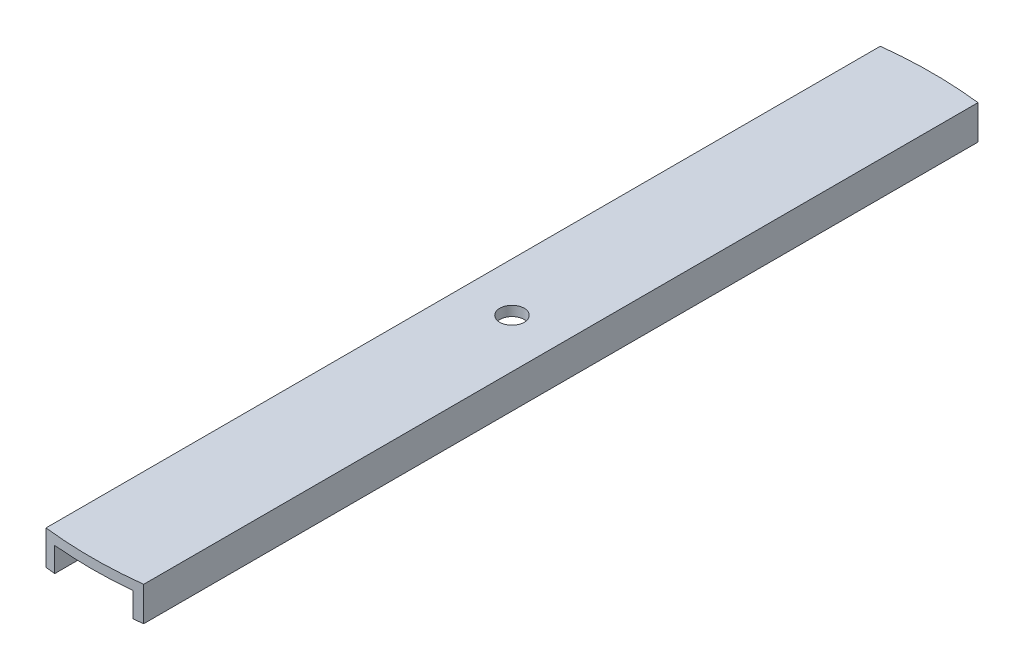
ISO-10303-21;
HEADER;
FILE_DESCRIPTION(('STEP AP214'),'2;1');
FILE_NAME('part.step','',(''),(''),'','','');
FILE_SCHEMA(('AUTOMOTIVE_DESIGN { 1 0 10303 214 1 1 1 1 }'));
ENDSEC;
DATA;
#1=APPLICATION_CONTEXT('core data for automotive mechanical design processes');
#2=APPLICATION_PROTOCOL_DEFINITION('international standard','automotive_design',2000,#1);
#3=PRODUCT_CONTEXT('',#1,'mechanical');
#4=PRODUCT('Part','Part','',(#3));
#5=PRODUCT_RELATED_PRODUCT_CATEGORY('part','',(#4));
#6=PRODUCT_DEFINITION_FORMATION('','',#4);
#7=PRODUCT_DEFINITION_CONTEXT('part definition',#1,'design');
#8=PRODUCT_DEFINITION('design','',#6,#7);
#9=PRODUCT_DEFINITION_SHAPE('','',#8);
#10=(LENGTH_UNIT() NAMED_UNIT(*) SI_UNIT(.MILLI.,.METRE.));
#11=(NAMED_UNIT(*) PLANE_ANGLE_UNIT() SI_UNIT($,.RADIAN.));
#12=(NAMED_UNIT(*) SI_UNIT($,.STERADIAN.) SOLID_ANGLE_UNIT());
#13=UNCERTAINTY_MEASURE_WITH_UNIT(LENGTH_MEASURE(1.E-05),#10,'distance_accuracy_value','');
#14=(GEOMETRIC_REPRESENTATION_CONTEXT(3) GLOBAL_UNCERTAINTY_ASSIGNED_CONTEXT((#13)) GLOBAL_UNIT_ASSIGNED_CONTEXT((#10,
#11,#12)) REPRESENTATION_CONTEXT('',''));
#15=CARTESIAN_POINT('',(0.,0.,0.));
#16=DIRECTION('',(0.,0.,1.));
#17=DIRECTION('',(1.,0.,0.));
#18=AXIS2_PLACEMENT_3D('',#15,#16,#17);
#19=CARTESIAN_POINT('',(-10.,0.,100.));
#20=DIRECTION('',(1.,0.,0.));
#21=DIRECTION('',(0.,0.,-1.));
#22=AXIS2_PLACEMENT_3D('',#19,#20,#21);
#23=PLANE('',#22);
#24=DIRECTION('',(0.,1.,0.));
#25=VECTOR('',#24,1.);
#26=CARTESIAN_POINT('',(-10.,-8.,-85.4166260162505));
#27=LINE('',#26,#25);
#28=CARTESIAN_POINT('',(-10.,-5.,-85.4166260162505));
#29=VERTEX_POINT('',#28);
#30=CARTESIAN_POINT('',(-10.,2.,-85.4166260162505));
#31=VERTEX_POINT('',#30);
#32=EDGE_CURVE('E54',#29,#31,#27,.T.);
#33=ORIENTED_EDGE('',*,*,#32,.F.);
#34=DIRECTION('',(0.,0.,-1.));
#35=VECTOR('',#34,1.);
#36=CARTESIAN_POINT('',(-10.,-5.,100.));
#37=LINE('',#36,#35);
#38=CARTESIAN_POINT('',(-10.,-5.,85.4166260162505));
#39=VERTEX_POINT('',#38);
#40=EDGE_CURVE('E12',#39,#29,#37,.T.);
#41=ORIENTED_EDGE('',*,*,#40,.F.);
#42=DIRECTION('',(0.,1.,0.));
#43=VECTOR('',#42,1.);
#44=CARTESIAN_POINT('',(-10.,-8.,85.4166260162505));
#45=LINE('',#44,#43);
#46=CARTESIAN_POINT('',(-10.,2.,85.4166260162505));
#47=VERTEX_POINT('',#46);
#48=EDGE_CURVE('E149',#47,#39,#45,.F.);
#49=ORIENTED_EDGE('',*,*,#48,.F.);
#50=DIRECTION('',(0.,0.,-1.));
#51=VECTOR('',#50,1.);
#52=CARTESIAN_POINT('',(-10.,2.,100.));
#53=LINE('',#52,#51);
#54=EDGE_CURVE('E114',#47,#31,#53,.T.);
#55=ORIENTED_EDGE('',*,*,#54,.T.);
#56=EDGE_LOOP('',(#33,#41,#49,#55));
#57=FACE_BOUND('',#56,.T.);
#58=ADVANCED_FACE('F31',(#57),#23,.F.);
#59=CARTESIAN_POINT('',(-8.,-5.,100.));
#60=DIRECTION('',(0.,-1.,0.));
#61=DIRECTION('',(0.,0.,-1.));
#62=AXIS2_PLACEMENT_3D('',#59,#60,#61);
#63=PLANE('',#62);
#64=DIRECTION('',(0.,0.,-1.));
#65=VECTOR('',#64,1.);
#66=CARTESIAN_POINT('',(-8.,-5.,100.));
#67=LINE('',#66,#65);
#68=CARTESIAN_POINT('',(-8.,-5.,85.6270985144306));
#69=VERTEX_POINT('',#68);
#70=CARTESIAN_POINT('',(-8.,-5.,-85.6270985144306));
#71=VERTEX_POINT('',#70);
#72=EDGE_CURVE('E39',#69,#71,#67,.T.);
#73=ORIENTED_EDGE('',*,*,#72,.F.);
#74=CARTESIAN_POINT('',(0.,-5.,0.));
#75=DIRECTION('',(0.,-1.,0.));
#76=DIRECTION('',(0.,0.,-1.));
#77=AXIS2_PLACEMENT_3D('',#74,#75,#76);
#78=CIRCLE('',#77,86.);
#79=EDGE_CURVE('E142',#69,#39,#78,.T.);
#80=ORIENTED_EDGE('',*,*,#79,.T.);
#81=ORIENTED_EDGE('',*,*,#40,.T.);
#82=EDGE_CURVE('E144',#29,#71,#78,.T.);
#83=ORIENTED_EDGE('',*,*,#82,.T.);
#84=EDGE_LOOP('',(#73,#80,#81,#83));
#85=FACE_BOUND('',#84,.T.);
#86=ADVANCED_FACE('F141',(#85),#63,.T.);
#87=CARTESIAN_POINT('',(-8.,0.,100.));
#88=DIRECTION('',(1.,0.,0.));
#89=DIRECTION('',(0.,0.,-1.));
#90=AXIS2_PLACEMENT_3D('',#87,#88,#89);
#91=PLANE('',#90);
#92=ORIENTED_EDGE('',*,*,#72,.T.);
#93=DIRECTION('',(0.,1.,0.));
#94=VECTOR('',#93,1.);
#95=CARTESIAN_POINT('',(-8.,-8.,-85.6270985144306));
#96=LINE('',#95,#94);
#97=CARTESIAN_POINT('',(-8.,0.,-85.6270985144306));
#98=VERTEX_POINT('',#97);
#99=EDGE_CURVE('E136',#71,#98,#96,.T.);
#100=ORIENTED_EDGE('',*,*,#99,.T.);
#101=DIRECTION('',(0.,0.,-1.));
#102=VECTOR('',#101,1.);
#103=CARTESIAN_POINT('',(-8.,0.,100.));
#104=LINE('',#103,#102);
#105=CARTESIAN_POINT('',(-8.,0.,85.6270985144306));
#106=VERTEX_POINT('',#105);
#107=EDGE_CURVE('E126',#106,#98,#104,.T.);
#108=ORIENTED_EDGE('',*,*,#107,.F.);
#109=DIRECTION('',(0.,1.,0.));
#110=VECTOR('',#109,1.);
#111=CARTESIAN_POINT('',(-8.,-8.,85.6270985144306));
#112=LINE('',#111,#110);
#113=EDGE_CURVE('E137',#106,#69,#112,.F.);
#114=ORIENTED_EDGE('',*,*,#113,.T.);
#115=EDGE_LOOP('',(#92,#100,#108,#114));
#116=FACE_BOUND('',#115,.T.);
#117=ADVANCED_FACE('F134',(#116),#91,.T.);
#118=CARTESIAN_POINT('',(-8.,0.,100.));
#119=DIRECTION('',(0.,-1.,0.));
#120=DIRECTION('',(0.,0.,-1.));
#121=AXIS2_PLACEMENT_3D('',#118,#119,#120);
#122=PLANE('',#121);
#123=CARTESIAN_POINT('',(0.,0.,0.));
#124=DIRECTION('',(0.,-1.,0.));
#125=DIRECTION('',(0.,0.,-1.));
#126=AXIS2_PLACEMENT_3D('',#123,#124,#125);
#127=CIRCLE('',#126,2.5);
#128=CARTESIAN_POINT('',(0.,0.,-2.5));
#129=VERTEX_POINT('',#128);
#130=EDGE_CURVE('E150',#129,#129,#127,.T.);
#131=ORIENTED_EDGE('',*,*,#130,.F.);
#132=EDGE_LOOP('',(#131));
#133=FACE_BOUND('',#132,.T.);
#134=DIRECTION('',(0.,0.,-1.));
#135=VECTOR('',#134,1.);
#136=CARTESIAN_POINT('',(8.,0.,100.));
#137=LINE('',#136,#135);
#138=CARTESIAN_POINT('',(8.,0.,85.6270985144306));
#139=VERTEX_POINT('',#138);
#140=CARTESIAN_POINT('',(8.,0.,-85.6270985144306));
#141=VERTEX_POINT('',#140);
#142=EDGE_CURVE('E123',#139,#141,#137,.T.);
#143=ORIENTED_EDGE('',*,*,#142,.F.);
#144=CARTESIAN_POINT('',(0.,0.,0.));
#145=DIRECTION('',(0.,-1.,0.));
#146=DIRECTION('',(0.,0.,-1.));
#147=AXIS2_PLACEMENT_3D('',#144,#145,#146);
#148=CIRCLE('',#147,86.);
#149=EDGE_CURVE('E152',#139,#106,#148,.T.);
#150=ORIENTED_EDGE('',*,*,#149,.T.);
#151=ORIENTED_EDGE('',*,*,#107,.T.);
#152=EDGE_CURVE('E147',#98,#141,#148,.T.);
#153=ORIENTED_EDGE('',*,*,#152,.T.);
#154=EDGE_LOOP('',(#143,#150,#151,#153));
#155=FACE_BOUND('',#154,.T.);
#156=ADVANCED_FACE('F191',(#133,#155),#122,.T.);
#157=CARTESIAN_POINT('',(8.,0.,100.));
#158=DIRECTION('',(-1.,0.,0.));
#159=DIRECTION('',(0.,0.,1.));
#160=AXIS2_PLACEMENT_3D('',#157,#158,#159);
#161=PLANE('',#160);
#162=DIRECTION('',(0.,0.,-1.));
#163=VECTOR('',#162,1.);
#164=CARTESIAN_POINT('',(8.,-5.,100.));
#165=LINE('',#164,#163);
#166=CARTESIAN_POINT('',(8.,-5.,85.6270985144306));
#167=VERTEX_POINT('',#166);
#168=CARTESIAN_POINT('',(8.,-5.,-85.6270985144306));
#169=VERTEX_POINT('',#168);
#170=EDGE_CURVE('E116',#167,#169,#165,.T.);
#171=ORIENTED_EDGE('',*,*,#170,.F.);
#172=DIRECTION('',(0.,1.,0.));
#173=VECTOR('',#172,1.);
#174=CARTESIAN_POINT('',(8.,-8.,85.6270985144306));
#175=LINE('',#174,#173);
#176=EDGE_CURVE('E155',#167,#139,#175,.T.);
#177=ORIENTED_EDGE('',*,*,#176,.T.);
#178=ORIENTED_EDGE('',*,*,#142,.T.);
#179=DIRECTION('',(0.,1.,0.));
#180=VECTOR('',#179,1.);
#181=CARTESIAN_POINT('',(8.,-8.,-85.6270985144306));
#182=LINE('',#181,#180);
#183=EDGE_CURVE('E185',#141,#169,#182,.F.);
#184=ORIENTED_EDGE('',*,*,#183,.T.);
#185=EDGE_LOOP('',(#171,#177,#178,#184));
#186=FACE_BOUND('',#185,.T.);
#187=ADVANCED_FACE('F195',(#186),#161,.T.);
#188=CARTESIAN_POINT('',(10.,-5.,100.));
#189=DIRECTION('',(0.,-1.,0.));
#190=DIRECTION('',(0.,0.,-1.));
#191=AXIS2_PLACEMENT_3D('',#188,#189,#190);
#192=PLANE('',#191);
#193=ORIENTED_EDGE('',*,*,#170,.T.);
#194=CARTESIAN_POINT('',(0.,-5.,0.));
#195=DIRECTION('',(0.,-1.,0.));
#196=DIRECTION('',(0.,0.,-1.));
#197=AXIS2_PLACEMENT_3D('',#194,#195,#196);
#198=CIRCLE('',#197,86.);
#199=CARTESIAN_POINT('',(10.,-5.,-85.4166260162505));
#200=VERTEX_POINT('',#199);
#201=EDGE_CURVE('E111',#169,#200,#198,.T.);
#202=ORIENTED_EDGE('',*,*,#201,.T.);
#203=DIRECTION('',(0.,0.,-1.));
#204=VECTOR('',#203,1.);
#205=CARTESIAN_POINT('',(10.,-5.,100.));
#206=LINE('',#205,#204);
#207=CARTESIAN_POINT('',(10.,-5.,85.4166260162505));
#208=VERTEX_POINT('',#207);
#209=EDGE_CURVE('E110',#208,#200,#206,.T.);
#210=ORIENTED_EDGE('',*,*,#209,.F.);
#211=EDGE_CURVE('E186',#208,#167,#198,.T.);
#212=ORIENTED_EDGE('',*,*,#211,.T.);
#213=EDGE_LOOP('',(#193,#202,#210,#212));
#214=FACE_BOUND('',#213,.T.);
#215=ADVANCED_FACE('F198',(#214),#192,.T.);
#216=CARTESIAN_POINT('',(10.,0.,100.));
#217=DIRECTION('',(-1.,0.,0.));
#218=DIRECTION('',(0.,0.,1.));
#219=AXIS2_PLACEMENT_3D('',#216,#217,#218);
#220=PLANE('',#219);
#221=DIRECTION('',(0.,1.,0.));
#222=VECTOR('',#221,1.);
#223=CARTESIAN_POINT('',(10.,-8.,85.4166260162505));
#224=LINE('',#223,#222);
#225=CARTESIAN_POINT('',(10.,2.,85.4166260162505));
#226=VERTEX_POINT('',#225);
#227=EDGE_CURVE('E46',#208,#226,#224,.T.);
#228=ORIENTED_EDGE('',*,*,#227,.F.);
#229=ORIENTED_EDGE('',*,*,#209,.T.);
#230=DIRECTION('',(0.,1.,0.));
#231=VECTOR('',#230,1.);
#232=CARTESIAN_POINT('',(10.,-8.,-85.4166260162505));
#233=LINE('',#232,#231);
#234=CARTESIAN_POINT('',(10.,2.,-85.4166260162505));
#235=VERTEX_POINT('',#234);
#236=EDGE_CURVE('E96',#235,#200,#233,.F.);
#237=ORIENTED_EDGE('',*,*,#236,.F.);
#238=DIRECTION('',(0.,0.,-1.));
#239=VECTOR('',#238,1.);
#240=CARTESIAN_POINT('',(10.,2.,100.));
#241=LINE('',#240,#239);
#242=EDGE_CURVE('E108',#226,#235,#241,.T.);
#243=ORIENTED_EDGE('',*,*,#242,.F.);
#244=EDGE_LOOP('',(#228,#229,#237,#243));
#245=FACE_BOUND('',#244,.T.);
#246=ADVANCED_FACE('F107',(#245),#220,.F.);
#247=CARTESIAN_POINT('',(-8.,2.,100.));
#248=DIRECTION('',(0.,-1.,0.));
#249=DIRECTION('',(0.,0.,-1.));
#250=AXIS2_PLACEMENT_3D('',#247,#248,#249);
#251=PLANE('',#250);
#252=CARTESIAN_POINT('',(0.,2.,0.));
#253=DIRECTION('',(0.,-1.,0.));
#254=DIRECTION('',(0.,0.,-1.));
#255=AXIS2_PLACEMENT_3D('',#252,#253,#254);
#256=CIRCLE('',#255,2.5);
#257=CARTESIAN_POINT('',(0.,2.,-2.5));
#258=VERTEX_POINT('',#257);
#259=EDGE_CURVE('E34',#258,#258,#256,.T.);
#260=ORIENTED_EDGE('',*,*,#259,.T.);
#261=EDGE_LOOP('',(#260));
#262=FACE_BOUND('',#261,.T.);
#263=CARTESIAN_POINT('',(0.,2.,0.));
#264=DIRECTION('',(0.,1.,0.));
#265=DIRECTION('',(0.,0.,1.));
#266=AXIS2_PLACEMENT_3D('',#263,#264,#265);
#267=CIRCLE('',#266,86.);
#268=EDGE_CURVE('E102',#47,#226,#267,.T.);
#269=ORIENTED_EDGE('',*,*,#268,.T.);
#270=ORIENTED_EDGE('',*,*,#242,.T.);
#271=EDGE_CURVE('E93',#235,#31,#267,.T.);
#272=ORIENTED_EDGE('',*,*,#271,.T.);
#273=ORIENTED_EDGE('',*,*,#54,.F.);
#274=EDGE_LOOP('',(#269,#270,#272,#273));
#275=FACE_BOUND('',#274,.T.);
#276=ADVANCED_FACE('F113',(#262,#275),#251,.F.);
#277=CARTESIAN_POINT('',(0.,10.,0.));
#278=DIRECTION('',(0.,-1.,0.));
#279=DIRECTION('',(0.,0.,-1.));
#280=AXIS2_PLACEMENT_3D('',#277,#278,#279);
#281=CYLINDRICAL_SURFACE('',#280,2.5);
#282=ORIENTED_EDGE('',*,*,#130,.T.);
#283=EDGE_LOOP('',(#282));
#284=FACE_BOUND('',#283,.T.);
#285=ORIENTED_EDGE('',*,*,#259,.F.);
#286=EDGE_LOOP('',(#285));
#287=FACE_BOUND('',#286,.T.);
#288=ADVANCED_FACE('F166',(#284,#287),#281,.F.);
#289=CARTESIAN_POINT('',(0.,-8.,0.));
#290=DIRECTION('',(0.,1.,0.));
#291=DIRECTION('',(0.,0.,1.));
#292=AXIS2_PLACEMENT_3D('',#289,#290,#291);
#293=CYLINDRICAL_SURFACE('',#292,86.);
#294=ORIENTED_EDGE('',*,*,#32,.T.);
#295=ORIENTED_EDGE('',*,*,#271,.F.);
#296=ORIENTED_EDGE('',*,*,#236,.T.);
#297=ORIENTED_EDGE('',*,*,#201,.F.);
#298=ORIENTED_EDGE('',*,*,#183,.F.);
#299=ORIENTED_EDGE('',*,*,#152,.F.);
#300=ORIENTED_EDGE('',*,*,#99,.F.);
#301=ORIENTED_EDGE('',*,*,#82,.F.);
#302=EDGE_LOOP('',(#294,#295,#296,#297,#298,#299,#300,#301));
#303=FACE_BOUND('',#302,.T.);
#304=ADVANCED_FACE('F95',(#303),#293,.T.);
#305=ORIENTED_EDGE('',*,*,#48,.T.);
#306=ORIENTED_EDGE('',*,*,#79,.F.);
#307=ORIENTED_EDGE('',*,*,#113,.F.);
#308=ORIENTED_EDGE('',*,*,#149,.F.);
#309=ORIENTED_EDGE('',*,*,#176,.F.);
#310=ORIENTED_EDGE('',*,*,#211,.F.);
#311=ORIENTED_EDGE('',*,*,#227,.T.);
#312=ORIENTED_EDGE('',*,*,#268,.F.);
#313=EDGE_LOOP('',(#305,#306,#307,#308,#309,#310,#311,#312));
#314=FACE_BOUND('',#313,.T.);
#315=ADVANCED_FACE('F173',(#314),#293,.T.);
#316=CLOSED_SHELL('',(#58,#86,#117,#156,#187,#215,#246,#276,#288,#304,#315));
#317=MANIFOLD_SOLID_BREP('B2',#316);
#318=ADVANCED_BREP_SHAPE_REPRESENTATION('',(#18,#317),#14);
#319=SHAPE_DEFINITION_REPRESENTATION(#9,#318);
ENDSEC;
END-ISO-10303-21;
